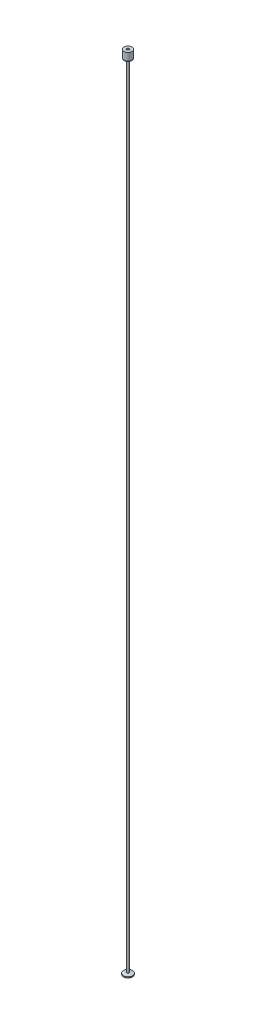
from build123d import *

# Parameters (mm, degrees)
SZKIC1_R                    = 6.9
DODANIE_WYCI_GNI_CIE1_DEPTH = 2.5
SFAZOWANIE1_SIZE            = 5
SFAZOWANIE1_SIZE2           = 0.881634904
SZKIC2_R                    = 1.5
DODANIE_WYCI_GNI_CIE2_DEPTH = 1200
DODANIE_WYCI_GNI_CIE3_START = -1
SZKIC3_R                    = 6
SZKIC3_R_2                  = 1.9
DODANIE_WYCI_GNI_CIE3_DEPTH = 13
ZAOKR_GLENIE1_R             = 2


with BuildPart() as part:
    # Szkic1 → Dodanie-wyci_gni_cie1 (new body)
    with BuildSketch(Plane(origin=(0, 0, 0), x_dir=(1, 0, 0), z_dir=(0, 1, 0))):
        with Locations(Location((0, 0, 0), (0, 0, 270))):
            Circle(SZKIC1_R)
    extrude(amount=DODANIE_WYCI_GNI_CIE1_DEPTH)

    # Sfazowanie1
    sfazowanie1_edges = [part.edges().sort_by_distance(p)[0] for p in [
        (0, 2.5, -6.9),
    ]]
    sfazowanie1_side = [part.faces().sort_by_distance(p)[0] for p in [
        (0, 2.5, 0),
    ]]
    chamfer(sfazowanie1_edges, length=SFAZOWANIE1_SIZE, length2=SFAZOWANIE1_SIZE2, reference=sfazowanie1_side[0])

    # Szkic2 → Dodanie-wyci_gni_cie2 (add)
    with BuildSketch(Plane(origin=(0, 2.5, 0), x_dir=(1, 0, 0), z_dir=(0, 1, 0))):
        with Locations(Location((0, 0, 0), (0, 0, 270))):
            Circle(SZKIC2_R)
    extrude(amount=DODANIE_WYCI_GNI_CIE2_DEPTH)


with BuildPart() as body_2:
    # Szkic3 → Dodanie-wyci_gni_cie3 (new body)
    with BuildSketch(Plane(origin=(0, 1202.5, 0), x_dir=(1, 0, 0), z_dir=(0, 1, 0)).offset(DODANIE_WYCI_GNI_CIE3_START)):
        with Locations(Location((0, 0, 0), (0, 0, 90))):
            Circle(SZKIC3_R)
        with Locations(Location((0, 0, 0), (0, 0, 90))):
            Circle(SZKIC3_R_2, mode=Mode.SUBTRACT)
    extrude(amount=DODANIE_WYCI_GNI_CIE3_DEPTH)

    # Zaokr_glenie1
    zaokr_glenie1_edges = [body_2.edges().sort_by_distance(p)[0] for p in [
        (0, 1201.5, 6),
    ]]
    fillet(zaokr_glenie1_edges, radius=ZAOKR_GLENIE1_R)


solid = Compound([part.part, body_2.part])
